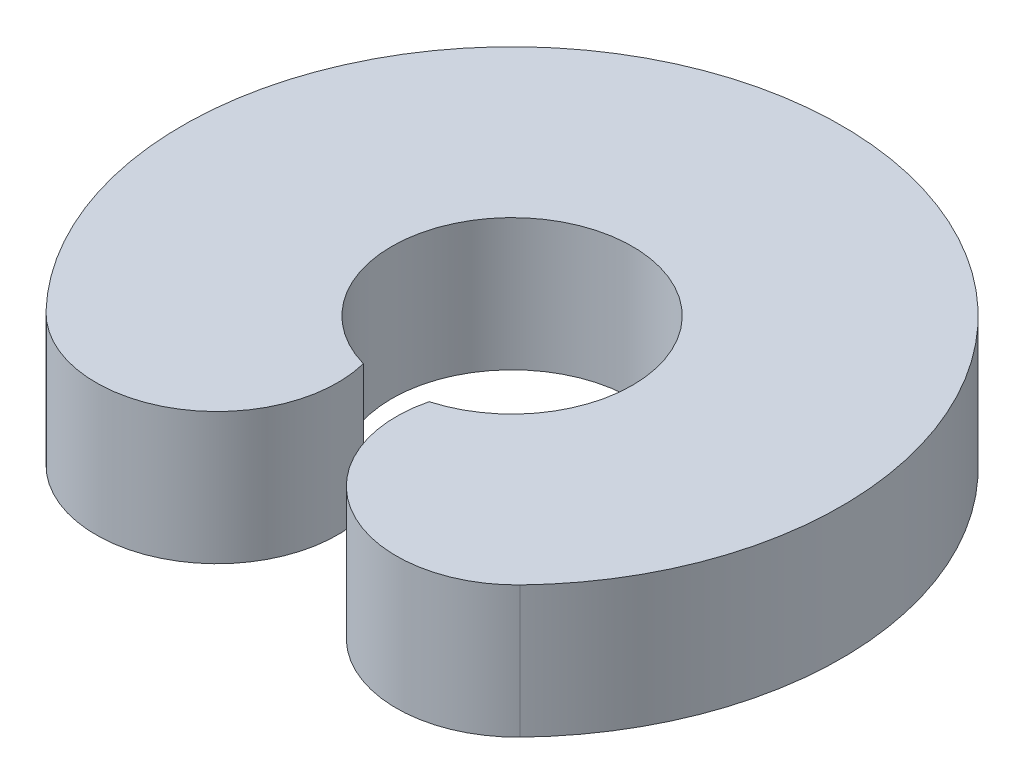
from build123d import *

# Parameters (mm, degrees)
EXTRUDE_1_DEPTH = 300


with BuildPart() as part:
    # Sketch 1 → Extrude 1 (new body)
    with BuildSketch(Plane(origin=(0, 0, 0), x_dir=(1, 0, 0), z_dir=(0, 1, 0))):
        with BuildLine():
            ThreePointArc((74.855080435, -263.434204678), (0, 273.86285484), (-74.855080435, -263.434204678))
            ThreePointArc((-74.855080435, -263.434204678), (-208.363759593, -570.483145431), (-539.504850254, -520.993777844))
            ThreePointArc((-539.504850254, -520.993777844), (0, 750), (539.504850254, -520.993777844))
            ThreePointArc((539.504850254, -520.993777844), (208.363759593, -570.483145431), (74.855080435, -263.434204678))
        make_face()
    extrude(amount=EXTRUDE_1_DEPTH)


solid = part.part
